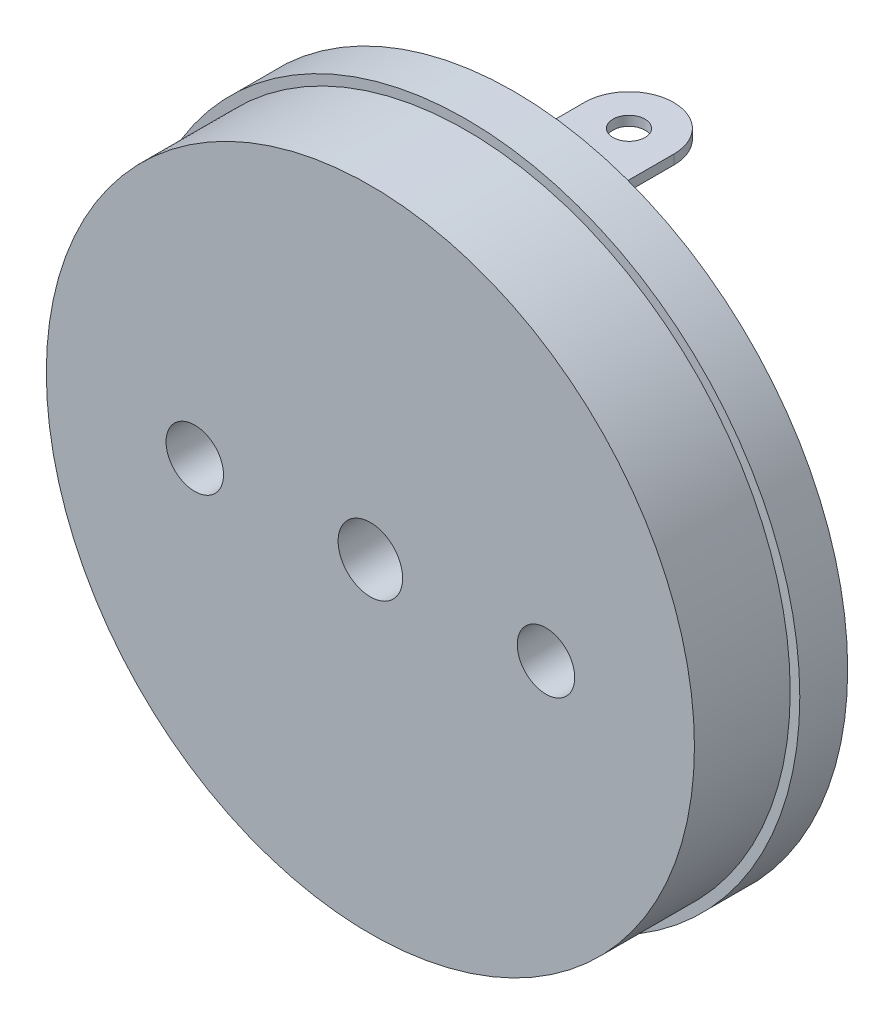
ISO-10303-21;
HEADER;
FILE_DESCRIPTION(('STEP AP214'),'2;1');
FILE_NAME('part.step','',(''),(''),'','','');
FILE_SCHEMA(('AUTOMOTIVE_DESIGN { 1 0 10303 214 1 1 1 1 }'));
ENDSEC;
DATA;
#1=APPLICATION_CONTEXT('core data for automotive mechanical design processes');
#2=APPLICATION_PROTOCOL_DEFINITION('international standard','automotive_design',2000,#1);
#3=PRODUCT_CONTEXT('',#1,'mechanical');
#4=PRODUCT('Part','Part','',(#3));
#5=PRODUCT_RELATED_PRODUCT_CATEGORY('part','',(#4));
#6=PRODUCT_DEFINITION_FORMATION('','',#4);
#7=PRODUCT_DEFINITION_CONTEXT('part definition',#1,'design');
#8=PRODUCT_DEFINITION('design','',#6,#7);
#9=PRODUCT_DEFINITION_SHAPE('','',#8);
#10=(LENGTH_UNIT() NAMED_UNIT(*) SI_UNIT(.MILLI.,.METRE.));
#11=(NAMED_UNIT(*) PLANE_ANGLE_UNIT() SI_UNIT($,.RADIAN.));
#12=(NAMED_UNIT(*) SI_UNIT($,.STERADIAN.) SOLID_ANGLE_UNIT());
#13=UNCERTAINTY_MEASURE_WITH_UNIT(LENGTH_MEASURE(1.E-05),#10,'distance_accuracy_value','');
#14=(GEOMETRIC_REPRESENTATION_CONTEXT(3) GLOBAL_UNCERTAINTY_ASSIGNED_CONTEXT((#13)) GLOBAL_UNIT_ASSIGNED_CONTEXT((#10,
#11,#12)) REPRESENTATION_CONTEXT('',''));
#15=CARTESIAN_POINT('',(0.,0.,0.));
#16=DIRECTION('',(0.,0.,1.));
#17=DIRECTION('',(1.,0.,0.));
#18=AXIS2_PLACEMENT_3D('',#15,#16,#17);
#19=CARTESIAN_POINT('',(0.,0.,0.));
#20=DIRECTION('',(0.,0.,1.));
#21=DIRECTION('',(1.,0.,0.));
#22=AXIS2_PLACEMENT_3D('',#19,#20,#21);
#23=PLANE('',#22);
#24=DIRECTION('',(1.,0.,0.));
#25=VECTOR('',#24,1.);
#26=CARTESIAN_POINT('',(2.81635245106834,-5.66058957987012,0.));
#27=LINE('',#26,#25);
#28=CARTESIAN_POINT('',(2.81635245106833,-5.66058957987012,0.));
#29=VERTEX_POINT('',#28);
#30=CARTESIAN_POINT('',(4.93558795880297,-5.66058957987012,0.));
#31=VERTEX_POINT('',#30);
#32=EDGE_CURVE('E180',#29,#31,#27,.T.);
#33=ORIENTED_EDGE('',*,*,#32,.F.);
#34=DIRECTION('',(0.,1.,0.));
#35=VECTOR('',#34,1.);
#36=CARTESIAN_POINT('',(2.81635245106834,-7.91924847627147,0.));
#37=LINE('',#36,#35);
#38=CARTESIAN_POINT('',(2.81635245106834,-7.91924847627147,0.));
#39=VERTEX_POINT('',#38);
#40=EDGE_CURVE('E56',#39,#29,#37,.T.);
#41=ORIENTED_EDGE('',*,*,#40,.F.);
#42=DIRECTION('',(-1.,0.,0.));
#43=VECTOR('',#42,1.);
#44=CARTESIAN_POINT('',(2.81635245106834,-7.91924847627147,0.));
#45=LINE('',#44,#43);
#46=CARTESIAN_POINT('',(4.93558795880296,-7.91924847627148,0.));
#47=VERTEX_POINT('',#46);
#48=EDGE_CURVE('E186',#47,#39,#45,.T.);
#49=ORIENTED_EDGE('',*,*,#48,.F.);
#50=DIRECTION('',(0.,-1.,0.));
#51=VECTOR('',#50,1.);
#52=CARTESIAN_POINT('',(4.93558795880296,-7.91924847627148,0.));
#53=LINE('',#52,#51);
#54=EDGE_CURVE('E169',#31,#47,#53,.T.);
#55=ORIENTED_EDGE('',*,*,#54,.F.);
#56=EDGE_LOOP('',(#33,#41,#49,#55));
#57=FACE_BOUND('',#56,.T.);
#58=CARTESIAN_POINT('',(-3.62500810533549,7.08270814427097,0.));
#59=DIRECTION('',(0.,0.,-1.));
#60=DIRECTION('',(-1.,0.,0.));
#61=AXIS2_PLACEMENT_3D('',#58,#59,#60);
#62=CIRCLE('',#61,1.1292433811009);
#63=CARTESIAN_POINT('',(-4.75425148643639,7.08270814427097,0.));
#64=VERTEX_POINT('',#63);
#65=EDGE_CURVE('E202',#64,#64,#62,.T.);
#66=ORIENTED_EDGE('',*,*,#65,.F.);
#67=EDGE_LOOP('',(#66));
#68=FACE_BOUND('',#67,.T.);
#69=DIRECTION('',(-1.,0.,0.));
#70=VECTOR('',#69,1.);
#71=CARTESIAN_POINT('',(1.4,-7.65,0.));
#72=LINE('',#71,#70);
#73=CARTESIAN_POINT('',(1.4,-7.65,0.));
#74=VERTEX_POINT('',#73);
#75=CARTESIAN_POINT('',(-1.4,-7.65,0.));
#76=VERTEX_POINT('',#75);
#77=EDGE_CURVE('E248',#74,#76,#72,.T.);
#78=ORIENTED_EDGE('',*,*,#77,.F.);
#79=DIRECTION('',(0.,-1.,0.));
#80=VECTOR('',#79,1.);
#81=CARTESIAN_POINT('',(1.4,-7.65,0.));
#82=LINE('',#81,#80);
#83=CARTESIAN_POINT('',(1.4,-7.35,0.));
#84=VERTEX_POINT('',#83);
#85=EDGE_CURVE('E257',#84,#74,#82,.T.);
#86=ORIENTED_EDGE('',*,*,#85,.F.);
#87=DIRECTION('',(1.,0.,0.));
#88=VECTOR('',#87,1.);
#89=CARTESIAN_POINT('',(1.4,-7.35,0.));
#90=LINE('',#89,#88);
#91=CARTESIAN_POINT('',(-1.4,-7.35,0.));
#92=VERTEX_POINT('',#91);
#93=EDGE_CURVE('E254',#92,#84,#90,.T.);
#94=ORIENTED_EDGE('',*,*,#93,.F.);
#95=DIRECTION('',(0.,1.,0.));
#96=VECTOR('',#95,1.);
#97=CARTESIAN_POINT('',(-1.4,-7.65,0.));
#98=LINE('',#97,#96);
#99=EDGE_CURVE('E251',#76,#92,#98,.T.);
#100=ORIENTED_EDGE('',*,*,#99,.F.);
#101=EDGE_LOOP('',(#78,#86,#94,#100));
#102=FACE_BOUND('',#101,.T.);
#103=CARTESIAN_POINT('',(0.,0.,0.));
#104=DIRECTION('',(0.,0.,1.));
#105=DIRECTION('',(1.,0.,0.));
#106=AXIS2_PLACEMENT_3D('',#103,#104,#105);
#107=CIRCLE('',#106,10.45);
#108=CARTESIAN_POINT('',(10.45,0.,0.));
#109=VERTEX_POINT('',#108);
#110=EDGE_CURVE('E315',#109,#109,#107,.T.);
#111=ORIENTED_EDGE('',*,*,#110,.F.);
#112=EDGE_LOOP('',(#111));
#113=FACE_BOUND('',#112,.T.);
#114=CARTESIAN_POINT('',(-5.5,0.,0.));
#115=DIRECTION('',(0.,0.,1.));
#116=DIRECTION('',(1.,0.,0.));
#117=AXIS2_PLACEMENT_3D('',#114,#115,#116);
#118=CIRCLE('',#117,0.899999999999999);
#119=CARTESIAN_POINT('',(-4.6,0.,0.));
#120=VERTEX_POINT('',#119);
#121=EDGE_CURVE('E306',#120,#120,#118,.T.);
#122=ORIENTED_EDGE('',*,*,#121,.T.);
#123=EDGE_LOOP('',(#122));
#124=FACE_BOUND('',#123,.T.);
#125=CARTESIAN_POINT('',(5.5,0.,0.));
#126=DIRECTION('',(0.,0.,1.));
#127=DIRECTION('',(-1.,0.,0.));
#128=AXIS2_PLACEMENT_3D('',#125,#126,#127);
#129=CIRCLE('',#128,0.899999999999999);
#130=CARTESIAN_POINT('',(4.6,0.,0.));
#131=VERTEX_POINT('',#130);
#132=EDGE_CURVE('E300',#131,#131,#129,.T.);
#133=ORIENTED_EDGE('',*,*,#132,.T.);
#134=EDGE_LOOP('',(#133));
#135=FACE_BOUND('',#134,.T.);
#136=CARTESIAN_POINT('',(0.,0.,0.));
#137=DIRECTION('',(0.,0.,-1.));
#138=DIRECTION('',(-1.,0.,0.));
#139=AXIS2_PLACEMENT_3D('',#136,#137,#138);
#140=CIRCLE('',#139,3.08);
#141=CARTESIAN_POINT('',(-2.3279941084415,2.01664162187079,0.));
#142=VERTEX_POINT('',#141);
#143=CARTESIAN_POINT('',(-2.3279941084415,-2.01664162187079,0.));
#144=VERTEX_POINT('',#143);
#145=EDGE_CURVE('E280',#142,#144,#140,.T.);
#146=ORIENTED_EDGE('',*,*,#145,.F.);
#147=DIRECTION('',(0.,1.,0.));
#148=VECTOR('',#147,1.);
#149=CARTESIAN_POINT('',(-2.3279941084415,2.01664162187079,0.));
#150=LINE('',#149,#148);
#151=EDGE_CURVE('E283',#144,#142,#150,.T.);
#152=ORIENTED_EDGE('',*,*,#151,.F.);
#153=EDGE_LOOP('',(#146,#152));
#154=FACE_BOUND('',#153,.T.);
#155=DIRECTION('',(0.,-1.,0.));
#156=VECTOR('',#155,1.);
#157=CARTESIAN_POINT('',(1.4,7.65,0.));
#158=LINE('',#157,#156);
#159=CARTESIAN_POINT('',(1.4,7.65,0.));
#160=VERTEX_POINT('',#159);
#161=CARTESIAN_POINT('',(1.4,7.35,0.));
#162=VERTEX_POINT('',#161);
#163=EDGE_CURVE('E222',#160,#162,#158,.T.);
#164=ORIENTED_EDGE('',*,*,#163,.F.);
#165=DIRECTION('',(1.,0.,0.));
#166=VECTOR('',#165,1.);
#167=CARTESIAN_POINT('',(1.4,7.65,0.));
#168=LINE('',#167,#166);
#169=CARTESIAN_POINT('',(-1.4,7.65,0.));
#170=VERTEX_POINT('',#169);
#171=EDGE_CURVE('E231',#170,#160,#168,.T.);
#172=ORIENTED_EDGE('',*,*,#171,.F.);
#173=DIRECTION('',(0.,1.,0.));
#174=VECTOR('',#173,1.);
#175=CARTESIAN_POINT('',(-1.4,7.65,0.));
#176=LINE('',#175,#174);
#177=CARTESIAN_POINT('',(-1.4,7.35,0.));
#178=VERTEX_POINT('',#177);
#179=EDGE_CURVE('E228',#178,#170,#176,.T.);
#180=ORIENTED_EDGE('',*,*,#179,.F.);
#181=DIRECTION('',(-1.,0.,0.));
#182=VECTOR('',#181,1.);
#183=CARTESIAN_POINT('',(1.4,7.35,0.));
#184=LINE('',#183,#182);
#185=EDGE_CURVE('E225',#162,#178,#184,.T.);
#186=ORIENTED_EDGE('',*,*,#185,.F.);
#187=EDGE_LOOP('',(#164,#172,#180,#186));
#188=FACE_BOUND('',#187,.T.);
#189=ADVANCED_FACE('F41',(#57,#68,#102,#113,#124,#135,#154,#188),#23,.F.);
#190=CARTESIAN_POINT('',(0.,0.,1.5));
#191=DIRECTION('',(0.,0.,1.));
#192=DIRECTION('',(1.,0.,0.));
#193=AXIS2_PLACEMENT_3D('',#190,#191,#192);
#194=PLANE('',#193);
#195=CARTESIAN_POINT('',(0.,0.,1.5));
#196=DIRECTION('',(0.,0.,1.));
#197=DIRECTION('',(1.,0.,0.));
#198=AXIS2_PLACEMENT_3D('',#195,#196,#197);
#199=CIRCLE('',#198,10.45);
#200=CARTESIAN_POINT('',(10.45,0.,1.5));
#201=VERTEX_POINT('',#200);
#202=EDGE_CURVE('E318',#201,#201,#199,.T.);
#203=ORIENTED_EDGE('',*,*,#202,.T.);
#204=EDGE_LOOP('',(#203));
#205=FACE_BOUND('',#204,.T.);
#206=CARTESIAN_POINT('',(0.,0.,1.5));
#207=DIRECTION('',(0.,0.,1.));
#208=DIRECTION('',(1.,0.,0.));
#209=AXIS2_PLACEMENT_3D('',#206,#207,#208);
#210=CIRCLE('',#209,10.15);
#211=CARTESIAN_POINT('',(10.15,0.,1.5));
#212=VERTEX_POINT('',#211);
#213=EDGE_CURVE('E309',#212,#212,#210,.T.);
#214=ORIENTED_EDGE('',*,*,#213,.F.);
#215=EDGE_LOOP('',(#214));
#216=FACE_BOUND('',#215,.T.);
#217=ADVANCED_FACE('F393',(#205,#216),#194,.T.);
#218=CARTESIAN_POINT('',(0.,0.,1.5));
#219=DIRECTION('',(0.,0.,-1.));
#220=DIRECTION('',(-1.,0.,0.));
#221=AXIS2_PLACEMENT_3D('',#218,#219,#220);
#222=CYLINDRICAL_SURFACE('',#221,10.45);
#223=ORIENTED_EDGE('',*,*,#202,.F.);
#224=EDGE_LOOP('',(#223));
#225=FACE_BOUND('',#224,.T.);
#226=ORIENTED_EDGE('',*,*,#110,.T.);
#227=EDGE_LOOP('',(#226));
#228=FACE_BOUND('',#227,.T.);
#229=ADVANCED_FACE('F43',(#225,#228),#222,.T.);
#230=CARTESIAN_POINT('',(0.,0.,4.5));
#231=DIRECTION('',(0.,0.,-1.));
#232=DIRECTION('',(-1.,0.,0.));
#233=AXIS2_PLACEMENT_3D('',#230,#231,#232);
#234=CYLINDRICAL_SURFACE('',#233,10.15);
#235=CARTESIAN_POINT('',(0.,0.,4.5));
#236=DIRECTION('',(0.,0.,1.));
#237=DIRECTION('',(1.,0.,0.));
#238=AXIS2_PLACEMENT_3D('',#235,#236,#237);
#239=CIRCLE('',#238,10.15);
#240=CARTESIAN_POINT('',(10.15,0.,4.5));
#241=VERTEX_POINT('',#240);
#242=EDGE_CURVE('E312',#241,#241,#239,.T.);
#243=ORIENTED_EDGE('',*,*,#242,.F.);
#244=EDGE_LOOP('',(#243));
#245=FACE_BOUND('',#244,.T.);
#246=ORIENTED_EDGE('',*,*,#213,.T.);
#247=EDGE_LOOP('',(#246));
#248=FACE_BOUND('',#247,.T.);
#249=ADVANCED_FACE('F400',(#245,#248),#234,.T.);
#250=CARTESIAN_POINT('',(0.,0.,4.5));
#251=DIRECTION('',(0.,0.,1.));
#252=DIRECTION('',(1.,0.,0.));
#253=AXIS2_PLACEMENT_3D('',#250,#251,#252);
#254=PLANE('',#253);
#255=CARTESIAN_POINT('',(0.,0.,4.5));
#256=DIRECTION('',(0.,0.,1.));
#257=DIRECTION('',(1.,0.,0.));
#258=AXIS2_PLACEMENT_3D('',#255,#256,#257);
#259=CIRCLE('',#258,1.01);
#260=CARTESIAN_POINT('',(1.01,0.,4.5));
#261=VERTEX_POINT('',#260);
#262=EDGE_CURVE('E274',#261,#261,#259,.T.);
#263=ORIENTED_EDGE('',*,*,#262,.F.);
#264=EDGE_LOOP('',(#263));
#265=FACE_BOUND('',#264,.T.);
#266=CARTESIAN_POINT('',(5.5,0.,4.5));
#267=DIRECTION('',(0.,0.,1.));
#268=DIRECTION('',(-1.,0.,0.));
#269=AXIS2_PLACEMENT_3D('',#266,#267,#268);
#270=CIRCLE('',#269,0.899999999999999);
#271=CARTESIAN_POINT('',(4.6,0.,4.5));
#272=VERTEX_POINT('',#271);
#273=EDGE_CURVE('E297',#272,#272,#270,.T.);
#274=ORIENTED_EDGE('',*,*,#273,.F.);
#275=EDGE_LOOP('',(#274));
#276=FACE_BOUND('',#275,.T.);
#277=CARTESIAN_POINT('',(-5.5,0.,4.5));
#278=DIRECTION('',(0.,0.,1.));
#279=DIRECTION('',(1.,0.,0.));
#280=AXIS2_PLACEMENT_3D('',#277,#278,#279);
#281=CIRCLE('',#280,0.899999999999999);
#282=CARTESIAN_POINT('',(-4.6,0.,4.5));
#283=VERTEX_POINT('',#282);
#284=EDGE_CURVE('E303',#283,#283,#281,.T.);
#285=ORIENTED_EDGE('',*,*,#284,.F.);
#286=EDGE_LOOP('',(#285));
#287=FACE_BOUND('',#286,.T.);
#288=ORIENTED_EDGE('',*,*,#242,.T.);
#289=EDGE_LOOP('',(#288));
#290=FACE_BOUND('',#289,.T.);
#291=ADVANCED_FACE('F403',(#265,#276,#287,#290),#254,.T.);
#292=CARTESIAN_POINT('',(-5.5,0.,0.));
#293=DIRECTION('',(0.,0.,1.));
#294=DIRECTION('',(1.,0.,0.));
#295=AXIS2_PLACEMENT_3D('',#292,#293,#294);
#296=CYLINDRICAL_SURFACE('',#295,0.899999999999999);
#297=ORIENTED_EDGE('',*,*,#121,.F.);
#298=EDGE_LOOP('',(#297));
#299=FACE_BOUND('',#298,.T.);
#300=ORIENTED_EDGE('',*,*,#284,.T.);
#301=EDGE_LOOP('',(#300));
#302=FACE_BOUND('',#301,.T.);
#303=ADVANCED_FACE('F407',(#299,#302),#296,.F.);
#304=CARTESIAN_POINT('',(5.5,0.,0.));
#305=DIRECTION('',(0.,0.,1.));
#306=DIRECTION('',(1.,0.,0.));
#307=AXIS2_PLACEMENT_3D('',#304,#305,#306);
#308=CYLINDRICAL_SURFACE('',#307,0.899999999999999);
#309=ORIENTED_EDGE('',*,*,#132,.F.);
#310=EDGE_LOOP('',(#309));
#311=FACE_BOUND('',#310,.T.);
#312=ORIENTED_EDGE('',*,*,#273,.T.);
#313=EDGE_LOOP('',(#312));
#314=FACE_BOUND('',#313,.T.);
#315=ADVANCED_FACE('F411',(#311,#314),#308,.F.);
#316=CARTESIAN_POINT('',(0.,0.,-2.));
#317=DIRECTION('',(0.,0.,1.));
#318=DIRECTION('',(1.,0.,0.));
#319=AXIS2_PLACEMENT_3D('',#316,#317,#318);
#320=CYLINDRICAL_SURFACE('',#319,3.08);
#321=ORIENTED_EDGE('',*,*,#145,.T.);
#322=DIRECTION('',(0.,0.,1.));
#323=VECTOR('',#322,1.);
#324=CARTESIAN_POINT('',(-2.3279941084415,-2.01664162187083,-2.));
#325=LINE('',#324,#323);
#326=CARTESIAN_POINT('',(-2.3279941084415,-2.01664162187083,-2.));
#327=VERTEX_POINT('',#326);
#328=EDGE_CURVE('E294',#327,#144,#325,.T.);
#329=ORIENTED_EDGE('',*,*,#328,.F.);
#330=CARTESIAN_POINT('',(0.,0.,-2.));
#331=DIRECTION('',(0.,0.,-1.));
#332=DIRECTION('',(-1.,0.,0.));
#333=AXIS2_PLACEMENT_3D('',#330,#331,#332);
#334=CIRCLE('',#333,3.08);
#335=CARTESIAN_POINT('',(-2.3279941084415,2.01664162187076,-2.));
#336=VERTEX_POINT('',#335);
#337=EDGE_CURVE('E286',#336,#327,#334,.T.);
#338=ORIENTED_EDGE('',*,*,#337,.F.);
#339=DIRECTION('',(0.,0.,1.));
#340=VECTOR('',#339,1.);
#341=CARTESIAN_POINT('',(-2.3279941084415,2.01664162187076,-2.));
#342=LINE('',#341,#340);
#343=EDGE_CURVE('E291',#336,#142,#342,.T.);
#344=ORIENTED_EDGE('',*,*,#343,.T.);
#345=EDGE_LOOP('',(#321,#329,#338,#344));
#346=FACE_BOUND('',#345,.T.);
#347=ADVANCED_FACE('F415',(#346),#320,.T.);
#348=CARTESIAN_POINT('',(-2.3279941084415,2.01664162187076,-2.));
#349=DIRECTION('',(1.,0.,0.));
#350=DIRECTION('',(0.,1.,0.));
#351=AXIS2_PLACEMENT_3D('',#348,#349,#350);
#352=PLANE('',#351);
#353=ORIENTED_EDGE('',*,*,#151,.T.);
#354=ORIENTED_EDGE('',*,*,#343,.F.);
#355=DIRECTION('',(0.,1.,0.));
#356=VECTOR('',#355,1.);
#357=CARTESIAN_POINT('',(-2.3279941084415,2.01664162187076,-2.));
#358=LINE('',#357,#356);
#359=EDGE_CURVE('E289',#327,#336,#358,.T.);
#360=ORIENTED_EDGE('',*,*,#359,.F.);
#361=ORIENTED_EDGE('',*,*,#328,.T.);
#362=EDGE_LOOP('',(#353,#354,#360,#361));
#363=FACE_BOUND('',#362,.T.);
#364=ADVANCED_FACE('F419',(#363),#352,.F.);
#365=CARTESIAN_POINT('',(0.,0.,-2.));
#366=DIRECTION('',(0.,0.,-1.));
#367=DIRECTION('',(-1.,0.,0.));
#368=AXIS2_PLACEMENT_3D('',#365,#366,#367);
#369=PLANE('',#368);
#370=CARTESIAN_POINT('',(0.,0.,-2.));
#371=DIRECTION('',(0.,0.,1.));
#372=DIRECTION('',(1.,0.,0.));
#373=AXIS2_PLACEMENT_3D('',#370,#371,#372);
#374=CIRCLE('',#373,1.01);
#375=CARTESIAN_POINT('',(1.01,0.,-2.));
#376=VERTEX_POINT('',#375);
#377=EDGE_CURVE('E277',#376,#376,#374,.T.);
#378=ORIENTED_EDGE('',*,*,#377,.T.);
#379=EDGE_LOOP('',(#378));
#380=FACE_BOUND('',#379,.T.);
#381=ORIENTED_EDGE('',*,*,#337,.T.);
#382=ORIENTED_EDGE('',*,*,#359,.T.);
#383=EDGE_LOOP('',(#381,#382));
#384=FACE_BOUND('',#383,.T.);
#385=ADVANCED_FACE('F423',(#380,#384),#369,.T.);
#386=CARTESIAN_POINT('',(0.,0.,-2.));
#387=DIRECTION('',(0.,0.,1.));
#388=DIRECTION('',(1.,0.,0.));
#389=AXIS2_PLACEMENT_3D('',#386,#387,#388);
#390=CYLINDRICAL_SURFACE('',#389,1.01);
#391=ORIENTED_EDGE('',*,*,#377,.F.);
#392=EDGE_LOOP('',(#391));
#393=FACE_BOUND('',#392,.T.);
#394=ORIENTED_EDGE('',*,*,#262,.T.);
#395=EDGE_LOOP('',(#394));
#396=FACE_BOUND('',#395,.T.);
#397=ADVANCED_FACE('F427',(#393,#396),#390,.F.);
#398=CARTESIAN_POINT('',(1.4,-7.65,-5.));
#399=DIRECTION('',(0.,1.,0.));
#400=DIRECTION('',(0.,0.,1.));
#401=AXIS2_PLACEMENT_3D('',#398,#399,#400);
#402=PLANE('',#401);
#403=CARTESIAN_POINT('',(0.,-7.65,-3.6));
#404=DIRECTION('',(0.,1.,0.));
#405=DIRECTION('',(0.,0.,1.));
#406=AXIS2_PLACEMENT_3D('',#403,#404,#405);
#407=CIRCLE('',#406,0.5);
#408=CARTESIAN_POINT('',(0.,-7.65,-3.1));
#409=VERTEX_POINT('',#408);
#410=EDGE_CURVE('E219',#409,#409,#407,.T.);
#411=ORIENTED_EDGE('',*,*,#410,.T.);
#412=EDGE_LOOP('',(#411));
#413=FACE_BOUND('',#412,.T.);
#414=DIRECTION('',(0.,0.,1.));
#415=VECTOR('',#414,1.);
#416=CARTESIAN_POINT('',(-1.4,-7.65,-5.));
#417=LINE('',#416,#415);
#418=CARTESIAN_POINT('',(-1.4,-7.64999999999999,-3.60999999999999));
#419=VERTEX_POINT('',#418);
#420=EDGE_CURVE('E272',#419,#76,#417,.T.);
#421=ORIENTED_EDGE('',*,*,#420,.F.);
#422=CARTESIAN_POINT('',(-0.0100000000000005,-7.65,-3.61));
#423=DIRECTION('',(0.,1.,0.));
#424=DIRECTION('',(0.,0.,1.));
#425=AXIS2_PLACEMENT_3D('',#422,#423,#424);
#426=CIRCLE('',#425,1.39);
#427=CARTESIAN_POINT('',(-0.0100000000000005,-7.65,-5.));
#428=VERTEX_POINT('',#427);
#429=EDGE_CURVE('E49',#419,#428,#426,.F.);
#430=ORIENTED_EDGE('',*,*,#429,.T.);
#431=DIRECTION('',(-1.,0.,0.));
#432=VECTOR('',#431,1.);
#433=CARTESIAN_POINT('',(1.4,-7.65,-5.));
#434=LINE('',#433,#432);
#435=CARTESIAN_POINT('',(0.01,-7.65,-5.));
#436=VERTEX_POINT('',#435);
#437=EDGE_CURVE('E260',#436,#428,#434,.T.);
#438=ORIENTED_EDGE('',*,*,#437,.F.);
#439=CARTESIAN_POINT('',(0.01,-7.65,-3.61));
#440=DIRECTION('',(0.,1.,0.));
#441=DIRECTION('',(0.,0.,1.));
#442=AXIS2_PLACEMENT_3D('',#439,#440,#441);
#443=CIRCLE('',#442,1.39);
#444=CARTESIAN_POINT('',(1.4,-7.65,-3.61));
#445=VERTEX_POINT('',#444);
#446=EDGE_CURVE('E64',#436,#445,#443,.F.);
#447=ORIENTED_EDGE('',*,*,#446,.T.);
#448=DIRECTION('',(0.,0.,1.));
#449=VECTOR('',#448,1.);
#450=CARTESIAN_POINT('',(1.4,-7.65,-5.));
#451=LINE('',#450,#449);
#452=EDGE_CURVE('E266',#445,#74,#451,.T.);
#453=ORIENTED_EDGE('',*,*,#452,.T.);
#454=ORIENTED_EDGE('',*,*,#77,.T.);
#455=EDGE_LOOP('',(#421,#430,#438,#447,#453,#454));
#456=FACE_BOUND('',#455,.T.);
#457=ADVANCED_FACE('F353',(#413,#456),#402,.F.);
#458=CARTESIAN_POINT('',(-1.4,-7.65,-5.));
#459=DIRECTION('',(1.,0.,0.));
#460=DIRECTION('',(0.,0.,-1.));
#461=AXIS2_PLACEMENT_3D('',#458,#459,#460);
#462=PLANE('',#461);
#463=DIRECTION('',(0.,0.,1.));
#464=VECTOR('',#463,1.);
#465=CARTESIAN_POINT('',(-1.4,-7.35,-5.));
#466=LINE('',#465,#464);
#467=CARTESIAN_POINT('',(-1.4,-7.35,-3.61));
#468=VERTEX_POINT('',#467);
#469=EDGE_CURVE('E270',#468,#92,#466,.T.);
#470=ORIENTED_EDGE('',*,*,#469,.F.);
#471=DIRECTION('',(0.,1.,0.));
#472=VECTOR('',#471,1.);
#473=CARTESIAN_POINT('',(-1.4,-7.64999999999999,-3.60999999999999));
#474=LINE('',#473,#472);
#475=EDGE_CURVE('E349',#468,#419,#474,.F.);
#476=ORIENTED_EDGE('',*,*,#475,.T.);
#477=ORIENTED_EDGE('',*,*,#420,.T.);
#478=ORIENTED_EDGE('',*,*,#99,.T.);
#479=EDGE_LOOP('',(#470,#476,#477,#478));
#480=FACE_BOUND('',#479,.T.);
#481=ADVANCED_FACE('F367',(#480),#462,.F.);
#482=CARTESIAN_POINT('',(1.4,-7.35,-5.));
#483=DIRECTION('',(0.,-1.,0.));
#484=DIRECTION('',(0.,0.,-1.));
#485=AXIS2_PLACEMENT_3D('',#482,#483,#484);
#486=PLANE('',#485);
#487=CARTESIAN_POINT('',(0.,-7.35,-3.6));
#488=DIRECTION('',(0.,-1.,0.));
#489=DIRECTION('',(0.,0.,-1.));
#490=AXIS2_PLACEMENT_3D('',#487,#488,#489);
#491=CIRCLE('',#490,0.5);
#492=CARTESIAN_POINT('',(0.,-7.35,-4.1));
#493=VERTEX_POINT('',#492);
#494=EDGE_CURVE('E216',#493,#493,#491,.T.);
#495=ORIENTED_EDGE('',*,*,#494,.T.);
#496=EDGE_LOOP('',(#495));
#497=FACE_BOUND('',#496,.T.);
#498=DIRECTION('',(1.,0.,0.));
#499=VECTOR('',#498,1.);
#500=CARTESIAN_POINT('',(1.4,-7.35,-5.));
#501=LINE('',#500,#499);
#502=CARTESIAN_POINT('',(-0.0100000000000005,-7.35,-5.));
#503=VERTEX_POINT('',#502);
#504=CARTESIAN_POINT('',(0.01,-7.35,-5.));
#505=VERTEX_POINT('',#504);
#506=EDGE_CURVE('E263',#503,#505,#501,.T.);
#507=ORIENTED_EDGE('',*,*,#506,.F.);
#508=CARTESIAN_POINT('',(-0.0100000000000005,-7.35,-3.61));
#509=DIRECTION('',(0.,-1.,0.));
#510=DIRECTION('',(0.,0.,-1.));
#511=AXIS2_PLACEMENT_3D('',#508,#509,#510);
#512=CIRCLE('',#511,1.39);
#513=EDGE_CURVE('E347',#503,#468,#512,.F.);
#514=ORIENTED_EDGE('',*,*,#513,.T.);
#515=ORIENTED_EDGE('',*,*,#469,.T.);
#516=ORIENTED_EDGE('',*,*,#93,.T.);
#517=DIRECTION('',(0.,0.,1.));
#518=VECTOR('',#517,1.);
#519=CARTESIAN_POINT('',(1.4,-7.35,-5.));
#520=LINE('',#519,#518);
#521=CARTESIAN_POINT('',(1.4,-7.35,-3.61));
#522=VERTEX_POINT('',#521);
#523=EDGE_CURVE('E268',#522,#84,#520,.T.);
#524=ORIENTED_EDGE('',*,*,#523,.F.);
#525=CARTESIAN_POINT('',(0.01,-7.35,-3.61));
#526=DIRECTION('',(0.,-1.,0.));
#527=DIRECTION('',(0.,0.,-1.));
#528=AXIS2_PLACEMENT_3D('',#525,#526,#527);
#529=CIRCLE('',#528,1.39);
#530=EDGE_CURVE('E345',#522,#505,#529,.F.);
#531=ORIENTED_EDGE('',*,*,#530,.T.);
#532=EDGE_LOOP('',(#507,#514,#515,#516,#524,#531));
#533=FACE_BOUND('',#532,.T.);
#534=ADVANCED_FACE('F364',(#497,#533),#486,.F.);
#535=CARTESIAN_POINT('',(1.4,-7.65,-5.));
#536=DIRECTION('',(-1.,0.,0.));
#537=DIRECTION('',(0.,0.,1.));
#538=AXIS2_PLACEMENT_3D('',#535,#536,#537);
#539=PLANE('',#538);
#540=ORIENTED_EDGE('',*,*,#452,.F.);
#541=DIRECTION('',(0.,-1.,0.));
#542=VECTOR('',#541,1.);
#543=CARTESIAN_POINT('',(1.4,-7.35,-3.61));
#544=LINE('',#543,#542);
#545=EDGE_CURVE('E11',#445,#522,#544,.F.);
#546=ORIENTED_EDGE('',*,*,#545,.T.);
#547=ORIENTED_EDGE('',*,*,#523,.T.);
#548=ORIENTED_EDGE('',*,*,#85,.T.);
#549=EDGE_LOOP('',(#540,#546,#547,#548));
#550=FACE_BOUND('',#549,.T.);
#551=ADVANCED_FACE('F375',(#550),#539,.F.);
#552=CARTESIAN_POINT('',(-1.4,-7.65,-5.));
#553=DIRECTION('',(0.,0.,-1.));
#554=DIRECTION('',(-1.,0.,0.));
#555=AXIS2_PLACEMENT_3D('',#552,#553,#554);
#556=PLANE('',#555);
#557=ORIENTED_EDGE('',*,*,#437,.T.);
#558=DIRECTION('',(0.,1.,0.));
#559=VECTOR('',#558,1.);
#560=CARTESIAN_POINT('',(-0.0100000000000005,-7.35,-5.));
#561=LINE('',#560,#559);
#562=EDGE_CURVE('E342',#428,#503,#561,.T.);
#563=ORIENTED_EDGE('',*,*,#562,.T.);
#564=ORIENTED_EDGE('',*,*,#506,.T.);
#565=DIRECTION('',(0.,-1.,0.));
#566=VECTOR('',#565,1.);
#567=CARTESIAN_POINT('',(0.01,-7.65,-5.));
#568=LINE('',#567,#566);
#569=EDGE_CURVE('E339',#505,#436,#568,.T.);
#570=ORIENTED_EDGE('',*,*,#569,.T.);
#571=EDGE_LOOP('',(#557,#563,#564,#570));
#572=FACE_BOUND('',#571,.T.);
#573=ADVANCED_FACE('F358',(#572),#556,.T.);
#574=CARTESIAN_POINT('',(1.4,7.65,-5.));
#575=DIRECTION('',(-1.,0.,0.));
#576=DIRECTION('',(0.,0.,1.));
#577=AXIS2_PLACEMENT_3D('',#574,#575,#576);
#578=PLANE('',#577);
#579=DIRECTION('',(0.,0.,1.));
#580=VECTOR('',#579,1.);
#581=CARTESIAN_POINT('',(1.4,7.35,-5.));
#582=LINE('',#581,#580);
#583=CARTESIAN_POINT('',(1.4,7.35,-3.61));
#584=VERTEX_POINT('',#583);
#585=EDGE_CURVE('E246',#584,#162,#582,.T.);
#586=ORIENTED_EDGE('',*,*,#585,.F.);
#587=DIRECTION('',(0.,-1.,0.));
#588=VECTOR('',#587,1.);
#589=CARTESIAN_POINT('',(1.4,7.65,-3.61));
#590=LINE('',#589,#588);
#591=CARTESIAN_POINT('',(1.4,7.65,-3.61));
#592=VERTEX_POINT('',#591);
#593=EDGE_CURVE('E331',#584,#592,#590,.F.);
#594=ORIENTED_EDGE('',*,*,#593,.T.);
#595=DIRECTION('',(0.,0.,1.));
#596=VECTOR('',#595,1.);
#597=CARTESIAN_POINT('',(1.4,7.65,-5.));
#598=LINE('',#597,#596);
#599=EDGE_CURVE('E240',#592,#160,#598,.T.);
#600=ORIENTED_EDGE('',*,*,#599,.T.);
#601=ORIENTED_EDGE('',*,*,#163,.T.);
#602=EDGE_LOOP('',(#586,#594,#600,#601));
#603=FACE_BOUND('',#602,.T.);
#604=ADVANCED_FACE('F444',(#603),#578,.F.);
#605=CARTESIAN_POINT('',(1.4,7.35,-5.));
#606=DIRECTION('',(0.,1.,0.));
#607=DIRECTION('',(0.,0.,1.));
#608=AXIS2_PLACEMENT_3D('',#605,#606,#607);
#609=PLANE('',#608);
#610=CARTESIAN_POINT('',(0.,7.35,-3.6));
#611=DIRECTION('',(0.,1.,0.));
#612=DIRECTION('',(0.,0.,1.));
#613=AXIS2_PLACEMENT_3D('',#610,#611,#612);
#614=CIRCLE('',#613,0.5);
#615=CARTESIAN_POINT('',(0.,7.35,-3.1));
#616=VERTEX_POINT('',#615);
#617=EDGE_CURVE('E213',#616,#616,#614,.T.);
#618=ORIENTED_EDGE('',*,*,#617,.T.);
#619=EDGE_LOOP('',(#618));
#620=FACE_BOUND('',#619,.T.);
#621=DIRECTION('',(-1.,0.,0.));
#622=VECTOR('',#621,1.);
#623=CARTESIAN_POINT('',(1.4,7.35,-5.));
#624=LINE('',#623,#622);
#625=CARTESIAN_POINT('',(0.01,7.35,-5.));
#626=VERTEX_POINT('',#625);
#627=CARTESIAN_POINT('',(-0.0100000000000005,7.35,-5.));
#628=VERTEX_POINT('',#627);
#629=EDGE_CURVE('E234',#626,#628,#624,.T.);
#630=ORIENTED_EDGE('',*,*,#629,.F.);
#631=CARTESIAN_POINT('',(0.01,7.35,-3.61));
#632=DIRECTION('',(0.,1.,0.));
#633=DIRECTION('',(0.,0.,1.));
#634=AXIS2_PLACEMENT_3D('',#631,#632,#633);
#635=CIRCLE('',#634,1.39);
#636=EDGE_CURVE('E329',#626,#584,#635,.F.);
#637=ORIENTED_EDGE('',*,*,#636,.T.);
#638=ORIENTED_EDGE('',*,*,#585,.T.);
#639=ORIENTED_EDGE('',*,*,#185,.T.);
#640=DIRECTION('',(0.,0.,1.));
#641=VECTOR('',#640,1.);
#642=CARTESIAN_POINT('',(-1.4,7.35,-5.));
#643=LINE('',#642,#641);
#644=CARTESIAN_POINT('',(-1.4,7.35000000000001,-3.61));
#645=VERTEX_POINT('',#644);
#646=EDGE_CURVE('E244',#645,#178,#643,.T.);
#647=ORIENTED_EDGE('',*,*,#646,.F.);
#648=CARTESIAN_POINT('',(-0.0100000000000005,7.35,-3.61));
#649=DIRECTION('',(0.,1.,0.));
#650=DIRECTION('',(0.,0.,1.));
#651=AXIS2_PLACEMENT_3D('',#648,#649,#650);
#652=CIRCLE('',#651,1.39);
#653=EDGE_CURVE('E327',#645,#628,#652,.F.);
#654=ORIENTED_EDGE('',*,*,#653,.T.);
#655=EDGE_LOOP('',(#630,#637,#638,#639,#647,#654));
#656=FACE_BOUND('',#655,.T.);
#657=ADVANCED_FACE('F447',(#620,#656),#609,.F.);
#658=CARTESIAN_POINT('',(-1.4,7.65,-5.));
#659=DIRECTION('',(1.,0.,0.));
#660=DIRECTION('',(0.,0.,-1.));
#661=AXIS2_PLACEMENT_3D('',#658,#659,#660);
#662=PLANE('',#661);
#663=DIRECTION('',(0.,0.,1.));
#664=VECTOR('',#663,1.);
#665=CARTESIAN_POINT('',(-1.4,7.65,-5.));
#666=LINE('',#665,#664);
#667=CARTESIAN_POINT('',(-1.4,7.65,-3.60999999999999));
#668=VERTEX_POINT('',#667);
#669=EDGE_CURVE('E242',#668,#170,#666,.T.);
#670=ORIENTED_EDGE('',*,*,#669,.F.);
#671=DIRECTION('',(0.,1.,0.));
#672=VECTOR('',#671,1.);
#673=CARTESIAN_POINT('',(-1.4,7.35000000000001,-3.61));
#674=LINE('',#673,#672);
#675=EDGE_CURVE('E337',#668,#645,#674,.F.);
#676=ORIENTED_EDGE('',*,*,#675,.T.);
#677=ORIENTED_EDGE('',*,*,#646,.T.);
#678=ORIENTED_EDGE('',*,*,#179,.T.);
#679=EDGE_LOOP('',(#670,#676,#677,#678));
#680=FACE_BOUND('',#679,.T.);
#681=ADVANCED_FACE('F451',(#680),#662,.F.);
#682=CARTESIAN_POINT('',(1.4,7.65,-5.));
#683=DIRECTION('',(0.,-1.,0.));
#684=DIRECTION('',(0.,0.,-1.));
#685=AXIS2_PLACEMENT_3D('',#682,#683,#684);
#686=PLANE('',#685);
#687=CARTESIAN_POINT('',(0.,7.65,-3.6));
#688=DIRECTION('',(0.,1.,0.));
#689=DIRECTION('',(0.,0.,1.));
#690=AXIS2_PLACEMENT_3D('',#687,#688,#689);
#691=CIRCLE('',#690,0.5);
#692=CARTESIAN_POINT('',(0.,7.65,-3.1));
#693=VERTEX_POINT('',#692);
#694=EDGE_CURVE('E210',#693,#693,#691,.T.);
#695=ORIENTED_EDGE('',*,*,#694,.F.);
#696=EDGE_LOOP('',(#695));
#697=FACE_BOUND('',#696,.T.);
#698=ORIENTED_EDGE('',*,*,#599,.F.);
#699=CARTESIAN_POINT('',(0.01,7.65,-3.61));
#700=DIRECTION('',(0.,-1.,0.));
#701=DIRECTION('',(0.,0.,-1.));
#702=AXIS2_PLACEMENT_3D('',#699,#700,#701);
#703=CIRCLE('',#702,1.39);
#704=CARTESIAN_POINT('',(0.01,7.65,-5.));
#705=VERTEX_POINT('',#704);
#706=EDGE_CURVE('E335',#592,#705,#703,.F.);
#707=ORIENTED_EDGE('',*,*,#706,.T.);
#708=DIRECTION('',(1.,0.,0.));
#709=VECTOR('',#708,1.);
#710=CARTESIAN_POINT('',(1.4,7.65,-5.));
#711=LINE('',#710,#709);
#712=CARTESIAN_POINT('',(-0.0100000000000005,7.65,-5.));
#713=VERTEX_POINT('',#712);
#714=EDGE_CURVE('E237',#713,#705,#711,.T.);
#715=ORIENTED_EDGE('',*,*,#714,.F.);
#716=CARTESIAN_POINT('',(-0.0100000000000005,7.65,-3.61));
#717=DIRECTION('',(0.,-1.,0.));
#718=DIRECTION('',(0.,0.,-1.));
#719=AXIS2_PLACEMENT_3D('',#716,#717,#718);
#720=CIRCLE('',#719,1.39);
#721=EDGE_CURVE('E333',#713,#668,#720,.F.);
#722=ORIENTED_EDGE('',*,*,#721,.T.);
#723=ORIENTED_EDGE('',*,*,#669,.T.);
#724=ORIENTED_EDGE('',*,*,#171,.T.);
#725=EDGE_LOOP('',(#698,#707,#715,#722,#723,#724));
#726=FACE_BOUND('',#725,.T.);
#727=ADVANCED_FACE('F455',(#697,#726),#686,.F.);
#728=CARTESIAN_POINT('',(1.4,7.35,-5.));
#729=DIRECTION('',(0.,0.,-1.));
#730=DIRECTION('',(-1.,0.,0.));
#731=AXIS2_PLACEMENT_3D('',#728,#729,#730);
#732=PLANE('',#731);
#733=ORIENTED_EDGE('',*,*,#714,.T.);
#734=DIRECTION('',(0.,-1.,0.));
#735=VECTOR('',#734,1.);
#736=CARTESIAN_POINT('',(0.01,7.35,-5.));
#737=LINE('',#736,#735);
#738=EDGE_CURVE('E324',#705,#626,#737,.T.);
#739=ORIENTED_EDGE('',*,*,#738,.T.);
#740=ORIENTED_EDGE('',*,*,#629,.T.);
#741=DIRECTION('',(0.,1.,0.));
#742=VECTOR('',#741,1.);
#743=CARTESIAN_POINT('',(-0.0100000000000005,7.65,-5.));
#744=LINE('',#743,#742);
#745=EDGE_CURVE('E321',#628,#713,#744,.T.);
#746=ORIENTED_EDGE('',*,*,#745,.T.);
#747=EDGE_LOOP('',(#733,#739,#740,#746));
#748=FACE_BOUND('',#747,.T.);
#749=ADVANCED_FACE('F459',(#748),#732,.T.);
#750=CARTESIAN_POINT('',(0.01,7.35,-3.61));
#751=DIRECTION('',(0.,1.,0.));
#752=DIRECTION('',(0.,0.,1.));
#753=AXIS2_PLACEMENT_3D('',#750,#751,#752);
#754=CYLINDRICAL_SURFACE('',#753,1.39);
#755=ORIENTED_EDGE('',*,*,#706,.F.);
#756=ORIENTED_EDGE('',*,*,#593,.F.);
#757=ORIENTED_EDGE('',*,*,#636,.F.);
#758=ORIENTED_EDGE('',*,*,#738,.F.);
#759=EDGE_LOOP('',(#755,#756,#757,#758));
#760=FACE_BOUND('',#759,.T.);
#761=ADVANCED_FACE('F463',(#760),#754,.T.);
#762=CARTESIAN_POINT('',(-0.0100000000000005,7.35,-3.61));
#763=DIRECTION('',(0.,-1.,0.));
#764=DIRECTION('',(0.,0.,-1.));
#765=AXIS2_PLACEMENT_3D('',#762,#763,#764);
#766=CYLINDRICAL_SURFACE('',#765,1.39);
#767=ORIENTED_EDGE('',*,*,#653,.F.);
#768=ORIENTED_EDGE('',*,*,#675,.F.);
#769=ORIENTED_EDGE('',*,*,#721,.F.);
#770=ORIENTED_EDGE('',*,*,#745,.F.);
#771=EDGE_LOOP('',(#767,#768,#769,#770));
#772=FACE_BOUND('',#771,.T.);
#773=ADVANCED_FACE('F390',(#772),#766,.T.);
#774=CARTESIAN_POINT('',(-0.0100000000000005,-7.65,-3.61));
#775=DIRECTION('',(0.,-1.,0.));
#776=DIRECTION('',(0.,0.,-1.));
#777=AXIS2_PLACEMENT_3D('',#774,#775,#776);
#778=CYLINDRICAL_SURFACE('',#777,1.39);
#779=ORIENTED_EDGE('',*,*,#429,.F.);
#780=ORIENTED_EDGE('',*,*,#475,.F.);
#781=ORIENTED_EDGE('',*,*,#513,.F.);
#782=ORIENTED_EDGE('',*,*,#562,.F.);
#783=EDGE_LOOP('',(#779,#780,#781,#782));
#784=FACE_BOUND('',#783,.T.);
#785=ADVANCED_FACE('F361',(#784),#778,.T.);
#786=CARTESIAN_POINT('',(0.01,-7.65,-3.61));
#787=DIRECTION('',(0.,1.,0.));
#788=DIRECTION('',(0.,0.,1.));
#789=AXIS2_PLACEMENT_3D('',#786,#787,#788);
#790=CYLINDRICAL_SURFACE('',#789,1.39);
#791=ORIENTED_EDGE('',*,*,#530,.F.);
#792=ORIENTED_EDGE('',*,*,#545,.F.);
#793=ORIENTED_EDGE('',*,*,#446,.F.);
#794=ORIENTED_EDGE('',*,*,#569,.F.);
#795=EDGE_LOOP('',(#791,#792,#793,#794));
#796=FACE_BOUND('',#795,.T.);
#797=ADVANCED_FACE('F379',(#796),#790,.T.);
#798=CARTESIAN_POINT('',(0.,-10.45,-3.6));
#799=DIRECTION('',(0.,1.,0.));
#800=DIRECTION('',(0.,0.,1.));
#801=AXIS2_PLACEMENT_3D('',#798,#799,#800);
#802=CYLINDRICAL_SURFACE('',#801,0.5);
#803=ORIENTED_EDGE('',*,*,#694,.T.);
#804=EDGE_LOOP('',(#803));
#805=FACE_BOUND('',#804,.T.);
#806=ORIENTED_EDGE('',*,*,#617,.F.);
#807=EDGE_LOOP('',(#806));
#808=FACE_BOUND('',#807,.T.);
#809=ADVANCED_FACE('F381',(#805,#808),#802,.F.);
#810=ORIENTED_EDGE('',*,*,#494,.F.);
#811=EDGE_LOOP('',(#810));
#812=FACE_BOUND('',#811,.T.);
#813=ORIENTED_EDGE('',*,*,#410,.F.);
#814=EDGE_LOOP('',(#813));
#815=FACE_BOUND('',#814,.T.);
#816=ADVANCED_FACE('F387',(#812,#815),#802,.F.);
#817=CARTESIAN_POINT('',(-3.6250081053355,7.08270814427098,0.999999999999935));
#818=DIRECTION('',(0.,0.,-1.));
#819=DIRECTION('',(-1.,0.,0.));
#820=AXIS2_PLACEMENT_3D('',#817,#818,#819);
#821=CYLINDRICAL_SURFACE('',#820,1.1292433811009);
#822=CARTESIAN_POINT('',(-3.6250081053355,7.08270814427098,0.999999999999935));
#823=DIRECTION('',(0.,0.,-1.));
#824=DIRECTION('',(-1.,0.,0.));
#825=AXIS2_PLACEMENT_3D('',#822,#823,#824);
#826=CIRCLE('',#825,1.1292433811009);
#827=CARTESIAN_POINT('',(-4.7542514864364,7.08270814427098,0.99999999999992));
#828=VERTEX_POINT('',#827);
#829=EDGE_CURVE('E207',#828,#828,#826,.T.);
#830=ORIENTED_EDGE('',*,*,#829,.F.);
#831=EDGE_LOOP('',(#830));
#832=FACE_BOUND('',#831,.T.);
#833=ORIENTED_EDGE('',*,*,#65,.T.);
#834=EDGE_LOOP('',(#833));
#835=FACE_BOUND('',#834,.T.);
#836=ADVANCED_FACE('F516',(#832,#835),#821,.F.);
#837=CARTESIAN_POINT('',(-3.6250081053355,7.08270814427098,0.999999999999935));
#838=DIRECTION('',(0.,0.,-1.));
#839=DIRECTION('',(-1.,0.,0.));
#840=AXIS2_PLACEMENT_3D('',#837,#838,#839);
#841=PLANE('',#840);
#842=ORIENTED_EDGE('',*,*,#829,.T.);
#843=EDGE_LOOP('',(#842));
#844=FACE_BOUND('',#843,.T.);
#845=ADVANCED_FACE('F525',(#844),#841,.T.);
#846=CARTESIAN_POINT('',(2.81635245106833,-7.91924847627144,1.00000000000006));
#847=DIRECTION('',(-1.,0.,0.));
#848=DIRECTION('',(0.,0.,1.));
#849=AXIS2_PLACEMENT_3D('',#846,#847,#848);
#850=PLANE('',#849);
#851=ORIENTED_EDGE('',*,*,#40,.T.);
#852=DIRECTION('',(0.,0.,-1.));
#853=VECTOR('',#852,1.);
#854=CARTESIAN_POINT('',(2.81635245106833,-5.66058957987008,1.00000000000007));
#855=LINE('',#854,#853);
#856=CARTESIAN_POINT('',(2.81635245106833,-5.66058957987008,1.00000000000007));
#857=VERTEX_POINT('',#856);
#858=EDGE_CURVE('E177',#857,#29,#855,.T.);
#859=ORIENTED_EDGE('',*,*,#858,.F.);
#860=DIRECTION('',(0.,1.,0.));
#861=VECTOR('',#860,1.);
#862=CARTESIAN_POINT('',(2.81635245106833,-7.91924847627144,1.00000000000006));
#863=LINE('',#862,#861);
#864=CARTESIAN_POINT('',(2.81635245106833,-7.91924847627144,1.00000000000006));
#865=VERTEX_POINT('',#864);
#866=EDGE_CURVE('E188',#865,#857,#863,.T.);
#867=ORIENTED_EDGE('',*,*,#866,.F.);
#868=DIRECTION('',(0.,0.,-1.));
#869=VECTOR('',#868,1.);
#870=CARTESIAN_POINT('',(2.81635245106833,-7.91924847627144,1.00000000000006));
#871=LINE('',#870,#869);
#872=EDGE_CURVE('E200',#865,#39,#871,.T.);
#873=ORIENTED_EDGE('',*,*,#872,.T.);
#874=EDGE_LOOP('',(#851,#859,#867,#873));
#875=FACE_BOUND('',#874,.T.);
#876=ADVANCED_FACE('F535',(#875),#850,.F.);
#877=CARTESIAN_POINT('',(2.81635245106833,-7.91924847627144,1.00000000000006));
#878=DIRECTION('',(0.,-1.,0.));
#879=DIRECTION('',(0.,0.,-1.));
#880=AXIS2_PLACEMENT_3D('',#877,#878,#879);
#881=PLANE('',#880);
#882=ORIENTED_EDGE('',*,*,#48,.T.);
#883=ORIENTED_EDGE('',*,*,#872,.F.);
#884=DIRECTION('',(-1.,0.,0.));
#885=VECTOR('',#884,1.);
#886=CARTESIAN_POINT('',(2.81635245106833,-7.91924847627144,1.00000000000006));
#887=LINE('',#886,#885);
#888=CARTESIAN_POINT('',(4.93558795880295,-7.91924847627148,1.00000000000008));
#889=VERTEX_POINT('',#888);
#890=EDGE_CURVE('E197',#889,#865,#887,.T.);
#891=ORIENTED_EDGE('',*,*,#890,.F.);
#892=DIRECTION('',(0.,0.,-1.));
#893=VECTOR('',#892,1.);
#894=CARTESIAN_POINT('',(4.93558795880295,-7.91924847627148,1.00000000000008));
#895=LINE('',#894,#893);
#896=EDGE_CURVE('E176',#889,#47,#895,.T.);
#897=ORIENTED_EDGE('',*,*,#896,.T.);
#898=EDGE_LOOP('',(#882,#883,#891,#897));
#899=FACE_BOUND('',#898,.T.);
#900=ADVANCED_FACE('F545',(#899),#881,.F.);
#901=CARTESIAN_POINT('',(4.93558795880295,-7.91924847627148,1.00000000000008));
#902=DIRECTION('',(1.,0.,0.));
#903=DIRECTION('',(0.,0.,-1.));
#904=AXIS2_PLACEMENT_3D('',#901,#902,#903);
#905=PLANE('',#904);
#906=ORIENTED_EDGE('',*,*,#54,.T.);
#907=ORIENTED_EDGE('',*,*,#896,.F.);
#908=DIRECTION('',(0.,-1.,0.));
#909=VECTOR('',#908,1.);
#910=CARTESIAN_POINT('',(4.93558795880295,-7.91924847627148,1.00000000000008));
#911=LINE('',#910,#909);
#912=CARTESIAN_POINT('',(4.93558795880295,-5.66058957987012,1.00000000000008));
#913=VERTEX_POINT('',#912);
#914=EDGE_CURVE('E172',#913,#889,#911,.T.);
#915=ORIENTED_EDGE('',*,*,#914,.F.);
#916=DIRECTION('',(0.,0.,-1.));
#917=VECTOR('',#916,1.);
#918=CARTESIAN_POINT('',(4.93558795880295,-5.66058957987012,1.00000000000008));
#919=LINE('',#918,#917);
#920=EDGE_CURVE('E165',#913,#31,#919,.T.);
#921=ORIENTED_EDGE('',*,*,#920,.T.);
#922=EDGE_LOOP('',(#906,#907,#915,#921));
#923=FACE_BOUND('',#922,.T.);
#924=ADVANCED_FACE('F167',(#923),#905,.F.);
#925=CARTESIAN_POINT('',(2.81635245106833,-5.66058957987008,1.00000000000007));
#926=DIRECTION('',(0.,1.,0.));
#927=DIRECTION('',(0.,0.,1.));
#928=AXIS2_PLACEMENT_3D('',#925,#926,#927);
#929=PLANE('',#928);
#930=ORIENTED_EDGE('',*,*,#32,.T.);
#931=ORIENTED_EDGE('',*,*,#920,.F.);
#932=DIRECTION('',(1.,0.,0.));
#933=VECTOR('',#932,1.);
#934=CARTESIAN_POINT('',(2.81635245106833,-5.66058957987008,1.00000000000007));
#935=LINE('',#934,#933);
#936=EDGE_CURVE('E194',#857,#913,#935,.T.);
#937=ORIENTED_EDGE('',*,*,#936,.F.);
#938=ORIENTED_EDGE('',*,*,#858,.T.);
#939=EDGE_LOOP('',(#930,#931,#937,#938));
#940=FACE_BOUND('',#939,.T.);
#941=ADVANCED_FACE('F181',(#940),#929,.F.);
#942=CARTESIAN_POINT('',(2.81635245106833,-5.66058957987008,1.00000000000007));
#943=DIRECTION('',(0.,0.,-1.));
#944=DIRECTION('',(-1.,0.,0.));
#945=AXIS2_PLACEMENT_3D('',#942,#943,#944);
#946=PLANE('',#945);
#947=ORIENTED_EDGE('',*,*,#866,.T.);
#948=ORIENTED_EDGE('',*,*,#936,.T.);
#949=ORIENTED_EDGE('',*,*,#914,.T.);
#950=ORIENTED_EDGE('',*,*,#890,.T.);
#951=EDGE_LOOP('',(#947,#948,#949,#950));
#952=FACE_BOUND('',#951,.T.);
#953=ADVANCED_FACE('F571',(#952),#946,.T.);
#954=CLOSED_SHELL('',(#189,#217,#229,#249,#291,#303,#315,#347,#364,#385,#397,#457,#481,#534,
#551,#573,#604,#657,#681,#727,#749,#761,#773,#785,#797,#809,#816,#836,#845,#876,#900,#924,#941,#953));
#955=MANIFOLD_SOLID_BREP('B2',#954);
#956=ADVANCED_BREP_SHAPE_REPRESENTATION('',(#18,#955),#14);
#957=SHAPE_DEFINITION_REPRESENTATION(#9,#956);
ENDSEC;
END-ISO-10303-21;
